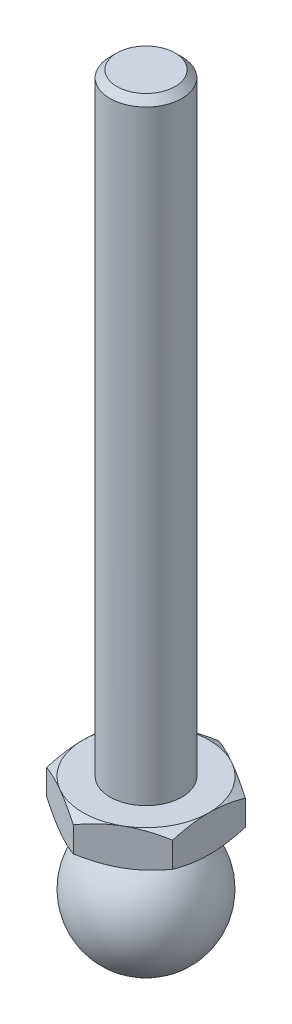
ISO-10303-21;
HEADER;
FILE_DESCRIPTION(('STEP AP214'),'2;1');
FILE_NAME('part.step','',(''),(''),'','','');
FILE_SCHEMA(('AUTOMOTIVE_DESIGN { 1 0 10303 214 1 1 1 1 }'));
ENDSEC;
DATA;
#1=APPLICATION_CONTEXT('core data for automotive mechanical design processes');
#2=APPLICATION_PROTOCOL_DEFINITION('international standard','automotive_design',2000,#1);
#3=PRODUCT_CONTEXT('',#1,'mechanical');
#4=PRODUCT('Part','Part','',(#3));
#5=PRODUCT_RELATED_PRODUCT_CATEGORY('part','',(#4));
#6=PRODUCT_DEFINITION_FORMATION('','',#4);
#7=PRODUCT_DEFINITION_CONTEXT('part definition',#1,'design');
#8=PRODUCT_DEFINITION('design','',#6,#7);
#9=PRODUCT_DEFINITION_SHAPE('','',#8);
#10=(LENGTH_UNIT() NAMED_UNIT(*) SI_UNIT(.MILLI.,.METRE.));
#11=(NAMED_UNIT(*) PLANE_ANGLE_UNIT() SI_UNIT($,.RADIAN.));
#12=(NAMED_UNIT(*) SI_UNIT($,.STERADIAN.) SOLID_ANGLE_UNIT());
#13=UNCERTAINTY_MEASURE_WITH_UNIT(LENGTH_MEASURE(1.E-05),#10,'distance_accuracy_value','');
#14=(GEOMETRIC_REPRESENTATION_CONTEXT(3) GLOBAL_UNCERTAINTY_ASSIGNED_CONTEXT((#13)) GLOBAL_UNIT_ASSIGNED_CONTEXT((#10,
#11,#12)) REPRESENTATION_CONTEXT('',''));
#15=CARTESIAN_POINT('',(0.,0.,0.));
#16=DIRECTION('',(0.,0.,1.));
#17=DIRECTION('',(1.,0.,0.));
#18=AXIS2_PLACEMENT_3D('',#15,#16,#17);
#19=CARTESIAN_POINT('',(0.,0.,0.));
#20=DIRECTION('',(0.,-1.,0.));
#21=DIRECTION('',(-1.,0.,0.));
#22=AXIS2_PLACEMENT_3D('',#19,#20,#21);
#23=SPHERICAL_SURFACE('',#22,7.);
#24=CARTESIAN_POINT('',(0.,5.74456264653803,0.));
#25=DIRECTION('',(0.,-1.,0.));
#26=DIRECTION('',(0.,0.,-1.));
#27=AXIS2_PLACEMENT_3D('',#24,#25,#26);
#28=CIRCLE('',#27,4.);
#29=CARTESIAN_POINT('',(0.,5.74456264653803,-4.));
#30=VERTEX_POINT('',#29);
#31=EDGE_CURVE('E348',#30,#30,#28,.F.);
#32=ORIENTED_EDGE('',*,*,#31,.F.);
#33=EDGE_LOOP('',(#32));
#34=FACE_BOUND('',#33,.T.);
#35=ADVANCED_FACE('F14',(#34),#23,.T.);
#36=CARTESIAN_POINT('',(0.,-7.,0.));
#37=DIRECTION('',(0.,-1.,0.));
#38=DIRECTION('',(0.,0.,-1.));
#39=AXIS2_PLACEMENT_3D('',#36,#37,#38);
#40=CYLINDRICAL_SURFACE('',#39,4.);
#41=ORIENTED_EDGE('',*,*,#31,.T.);
#42=EDGE_LOOP('',(#41));
#43=FACE_BOUND('',#42,.T.);
#44=CARTESIAN_POINT('',(0.,6.8,0.));
#45=DIRECTION('',(0.,-1.,0.));
#46=DIRECTION('',(0.,0.,-1.));
#47=AXIS2_PLACEMENT_3D('',#44,#45,#46);
#48=CIRCLE('',#47,4.);
#49=CARTESIAN_POINT('',(0.,6.8,-4.));
#50=VERTEX_POINT('',#49);
#51=EDGE_CURVE('E145',#50,#50,#48,.T.);
#52=ORIENTED_EDGE('',*,*,#51,.T.);
#53=EDGE_LOOP('',(#52));
#54=FACE_BOUND('',#53,.T.);
#55=ADVANCED_FACE('F340',(#43,#54),#40,.T.);
#56=CARTESIAN_POINT('',(7.,6.8,0.));
#57=DIRECTION('',(0.,1.,0.));
#58=DIRECTION('',(0.,0.,1.));
#59=AXIS2_PLACEMENT_3D('',#56,#57,#58);
#60=PLANE('',#59);
#61=ORIENTED_EDGE('',*,*,#51,.F.);
#62=EDGE_LOOP('',(#61));
#63=FACE_BOUND('',#62,.T.);
#64=CARTESIAN_POINT('',(0.,6.8,0.));
#65=DIRECTION('',(0.,-1.,0.));
#66=DIRECTION('',(0.,0.,-1.));
#67=AXIS2_PLACEMENT_3D('',#64,#65,#66);
#68=CIRCLE('',#67,7.);
#69=CARTESIAN_POINT('',(3.5,6.8,-6.06217782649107));
#70=VERTEX_POINT('',#69);
#71=CARTESIAN_POINT('',(7.,6.8,0.));
#72=VERTEX_POINT('',#71);
#73=EDGE_CURVE('E144',#70,#72,#68,.T.);
#74=ORIENTED_EDGE('',*,*,#73,.T.);
#75=CARTESIAN_POINT('',(3.5,6.8,6.06217782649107));
#76=VERTEX_POINT('',#75);
#77=EDGE_CURVE('E140',#72,#76,#68,.T.);
#78=ORIENTED_EDGE('',*,*,#77,.T.);
#79=CARTESIAN_POINT('',(-3.5,6.8,6.06217782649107));
#80=VERTEX_POINT('',#79);
#81=EDGE_CURVE('E143',#76,#80,#68,.T.);
#82=ORIENTED_EDGE('',*,*,#81,.T.);
#83=CARTESIAN_POINT('',(-7.,6.8,0.));
#84=VERTEX_POINT('',#83);
#85=EDGE_CURVE('E270',#80,#84,#68,.T.);
#86=ORIENTED_EDGE('',*,*,#85,.T.);
#87=CARTESIAN_POINT('',(-3.5,6.8,-6.06217782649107));
#88=VERTEX_POINT('',#87);
#89=EDGE_CURVE('E259',#84,#88,#68,.T.);
#90=ORIENTED_EDGE('',*,*,#89,.T.);
#91=EDGE_CURVE('E262',#88,#70,#68,.T.);
#92=ORIENTED_EDGE('',*,*,#91,.T.);
#93=EDGE_LOOP('',(#74,#78,#82,#86,#90,#92));
#94=FACE_BOUND('',#93,.T.);
#95=ADVANCED_FACE('F267',(#63,#94),#60,.F.);
#96=CARTESIAN_POINT('',(0.,7.60829037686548,0.));
#97=DIRECTION('',(0.,1.,0.));
#98=DIRECTION('',(0.,0.,1.));
#99=AXIS2_PLACEMENT_3D('',#96,#97,#98);
#100=CONICAL_SURFACE('',#99,8.4,1.0471975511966);
#101=CARTESIAN_POINT('',(-7.,10.8617173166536,-12.1648696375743));
#102=CARTESIAN_POINT('',(-7.,10.716084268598,-11.8738003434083));
#103=CARTESIAN_POINT('',(-7.,10.57145410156,-11.5822239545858));
#104=CARTESIAN_POINT('',(-7.,10.2846843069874,-10.997825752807));
#105=CARTESIAN_POINT('',(-7.,10.1425448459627,-10.7050038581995));
#106=CARTESIAN_POINT('',(-7.,9.86097785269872,-10.1173316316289));
#107=CARTESIAN_POINT('',(-7.,9.72155635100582,-9.82247840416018));
#108=CARTESIAN_POINT('',(-7.,9.44639395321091,-9.23106328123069));
#109=CARTESIAN_POINT('',(-7.,9.31065298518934,-8.93450141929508));
#110=CARTESIAN_POINT('',(-7.,9.03768895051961,-8.32593520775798));
#111=CARTESIAN_POINT('',(-7.,8.90067452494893,-8.01383696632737));
#112=CARTESIAN_POINT('',(-7.,8.63286162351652,-7.38695797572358));
#113=CARTESIAN_POINT('',(-7.,8.50206342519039,-7.07217710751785));
#114=CARTESIAN_POINT('',(-7.,8.24844698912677,-6.43962449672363));
#115=CARTESIAN_POINT('',(-7.,8.125623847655,-6.12185473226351));
#116=CARTESIAN_POINT('',(-7.,7.8900983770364,-5.48260317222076));
#117=CARTESIAN_POINT('',(-7.,7.77739494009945,-5.16112178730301));
#118=CARTESIAN_POINT('',(-7.,7.54009853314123,-4.4382173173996));
#119=CARTESIAN_POINT('',(-7.,7.41888185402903,-4.03566892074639));
#120=CARTESIAN_POINT('',(-7.,7.20302599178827,-3.22331060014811));
#121=CARTESIAN_POINT('',(-7.,7.10838447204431,-2.81350131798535));
#122=CARTESIAN_POINT('',(-7.,6.99300008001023,-2.19742561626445));
#123=CARTESIAN_POINT('',(-7.,6.95914818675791,-1.99359214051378));
#124=CARTESIAN_POINT('',(-7.,6.90068089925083,-1.58461613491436));
#125=CARTESIAN_POINT('',(-7.,6.8760641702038,-1.37947379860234));
#126=CARTESIAN_POINT('',(-7.,6.83680318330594,-0.968289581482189));
#127=CARTESIAN_POINT('',(-7.,6.82215603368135,-0.76224797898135));
#128=CARTESIAN_POINT('',(-7.,6.80329784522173,-0.349683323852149));
#129=CARTESIAN_POINT('',(-7.,6.79908676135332,-0.143160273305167));
#130=CARTESIAN_POINT('',(-7.,6.80125062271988,0.271082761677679));
#131=CARTESIAN_POINT('',(-7.,6.80768992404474,0.478802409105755));
#132=CARTESIAN_POINT('',(-7.,6.83105663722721,0.893645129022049));
#133=CARTESIAN_POINT('',(-7.,6.84798409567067,1.10076819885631));
#134=CARTESIAN_POINT('',(-7.,6.89178752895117,1.51403043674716));
#135=CARTESIAN_POINT('',(-7.,6.91866726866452,1.72016920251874));
#136=CARTESIAN_POINT('',(-7.,6.98158190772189,2.13103319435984));
#137=CARTESIAN_POINT('',(-7.,7.01761712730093,2.33575837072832));
#138=CARTESIAN_POINT('',(-7.,7.13943134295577,2.95437912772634));
#139=CARTESIAN_POINT('',(-7.,7.23812704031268,3.3657507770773));
#140=CARTESIAN_POINT('',(-7.,7.46154661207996,4.18138012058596));
#141=CARTESIAN_POINT('',(-7.,7.58628518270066,4.58563365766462));
#142=CARTESIAN_POINT('',(-7.,7.82667516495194,5.3032089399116));
#143=CARTESIAN_POINT('',(-7.,7.93871240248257,5.61775957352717));
#144=CARTESIAN_POINT('',(-7.,8.17214855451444,6.24325021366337));
#145=CARTESIAN_POINT('',(-7.,8.29354488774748,6.55419118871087));
#146=CARTESIAN_POINT('',(-7.,8.54379295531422,7.17328528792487));
#147=CARTESIAN_POINT('',(-7.,8.67264966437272,7.48143638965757));
#148=CARTESIAN_POINT('',(-7.,8.93621768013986,8.09523802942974));
#149=CARTESIAN_POINT('',(-7.,9.07092934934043,8.40088841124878));
#150=CARTESIAN_POINT('',(-7.,9.33921592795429,8.99716345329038));
#151=CARTESIAN_POINT('',(-7.,9.47259682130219,9.28787568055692));
#152=CARTESIAN_POINT('',(-7.,9.74285284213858,9.86766295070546));
#153=CARTESIAN_POINT('',(-7.,9.87972791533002,10.1567380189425));
#154=CARTESIAN_POINT('',(-7.,10.1561021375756,10.7329937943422));
#155=CARTESIAN_POINT('',(-7.,10.2955961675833,11.0201769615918));
#156=CARTESIAN_POINT('',(-7.,10.5769771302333,11.5933594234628));
#157=CARTESIAN_POINT('',(-7.,10.7188639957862,11.879358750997));
#158=CARTESIAN_POINT('',(-7.,10.8617173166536,12.1648696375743));
#159=B_SPLINE_CURVE_WITH_KNOTS('',3,(#101,#102,#103,#104,#105,#106,#107,#108,#109,#110,#111,
#112,#113,#114,#115,#116,#117,#118,#119,#120,#121,#122,#123,#124,#125,#126,#127,#128,#129,#130,
#131,#132,#133,#134,#135,#136,#137,#138,#139,#140,#141,#142,#143,#144,#145,#146,#147,#148,#149,
#150,#151,#152,#153,#154,#155,#156,#157,#158),.UNSPECIFIED.,.F.,.F.,(4,2,2,2,2,2,2,2,2,2,2,2,2,
2,2,2,2,2,2,2,2,2,2,2,2,2,2,2,4),(0.,0.976413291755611,1.95289161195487,2.93133423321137,
3.90975772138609,4.93225217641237,5.95479223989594,6.97669748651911,7.99849072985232,
9.25906449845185,10.5195273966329,11.1392271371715,11.7588372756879,12.3782676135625,
12.9976952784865,13.6208795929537,14.2440666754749,14.8674897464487,15.490934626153,
16.758797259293,18.0273773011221,19.0289263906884,20.0302002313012,21.0321496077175,
22.0341611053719,22.9936838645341,23.9531917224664,24.9109871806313,25.8687558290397),.UNSPECIFIED.);
#160=CARTESIAN_POINT('',(-7.,7.42521478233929,4.04145188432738));
#161=VERTEX_POINT('',#160);
#162=EDGE_CURVE('E156',#84,#161,#159,.T.);
#163=ORIENTED_EDGE('',*,*,#162,.F.);
#164=ORIENTED_EDGE('',*,*,#85,.F.);
#165=CARTESIAN_POINT('',(-7.0002,7.42528145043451,4.04133641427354));
#166=CARTESIAN_POINT('',(-6.84633209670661,7.37399984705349,4.13017208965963));
#167=CARTESIAN_POINT('',(-6.69189049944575,7.32504559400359,4.21933898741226));
#168=CARTESIAN_POINT('',(-6.38175307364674,7.23243278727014,4.39839691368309));
#169=CARTESIAN_POINT('',(-6.22605673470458,7.18877651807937,4.48828823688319));
#170=CARTESIAN_POINT('',(-5.75647483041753,7.0666115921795,4.75940147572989));
#171=CARTESIAN_POINT('',(-5.4407356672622,6.99712555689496,4.94169356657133));
#172=CARTESIAN_POINT('',(-4.96823775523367,6.9156449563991,5.21449036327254));
#173=CARTESIAN_POINT('',(-4.81289077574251,6.89243348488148,5.30417998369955));
#174=CARTESIAN_POINT('',(-4.50149488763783,6.85351121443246,5.48396448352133));
#175=CARTESIAN_POINT('',(-4.34544604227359,6.83779975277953,5.57405932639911));
#176=CARTESIAN_POINT('',(-4.03307732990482,6.81427791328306,5.75440548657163));
#177=CARTESIAN_POINT('',(-3.87675797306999,6.80645856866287,5.84465650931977));
#178=CARTESIAN_POINT('',(-3.56398349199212,6.79888024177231,6.02523694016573));
#179=CARTESIAN_POINT('',(-3.40752837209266,6.79912101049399,6.11556634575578));
#180=CARTESIAN_POINT('',(-2.97889312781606,6.8108597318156,6.36303901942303));
#181=CARTESIAN_POINT('',(-2.7068533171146,6.83056574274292,6.52010127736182));
#182=CARTESIAN_POINT('',(-2.1645805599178,6.89305346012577,6.83318259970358));
#183=CARTESIAN_POINT('',(-1.89434952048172,6.93585652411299,6.9892005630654));
#184=CARTESIAN_POINT('',(-1.35098545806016,7.04285167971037,7.30291195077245));
#185=CARTESIAN_POINT('',(-1.07792099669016,7.10749709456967,7.46056579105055));
#186=CARTESIAN_POINT('',(-0.535864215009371,7.25421607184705,7.77352241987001));
#187=CARTESIAN_POINT('',(-0.26686495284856,7.33625517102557,7.92882921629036));
#188=CARTESIAN_POINT('',(0.000200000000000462,7.42528145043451,8.08301923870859));
#189=B_SPLINE_CURVE_WITH_KNOTS('',3,(#165,#166,#167,#168,#169,#170,#171,#172,#173,#174,#175,
#176,#177,#178,#179,#180,#181,#182,#183,#184,#185,#186,#187,#188),.UNSPECIFIED.,.F.,.F.,(4,2,2,
2,2,2,2,2,2,2,2,4),(0.,0.554727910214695,1.10969417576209,2.2219327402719,2.76443041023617,
3.30688013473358,3.8487128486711,4.39052882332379,5.33376515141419,6.27787517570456,
7.2429241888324,8.20607866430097),.UNSPECIFIED.);
#190=EDGE_CURVE('E120',#161,#80,#189,.T.);
#191=ORIENTED_EDGE('',*,*,#190,.F.);
#192=EDGE_LOOP('',(#163,#164,#191));
#193=FACE_BOUND('',#192,.T.);
#194=ADVANCED_FACE('F280',(#193),#100,.T.);
#195=CARTESIAN_POINT('',(0.000200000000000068,7.42528145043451,-8.08301923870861));
#196=CARTESIAN_POINT('',(-0.153667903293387,7.37399984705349,-7.99418356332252));
#197=CARTESIAN_POINT('',(-0.308109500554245,7.32504559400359,-7.90501666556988));
#198=CARTESIAN_POINT('',(-0.618246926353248,7.23243278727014,-7.72595873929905));
#199=CARTESIAN_POINT('',(-0.77394326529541,7.18877651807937,-7.63606741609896));
#200=CARTESIAN_POINT('',(-1.24352516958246,7.0666115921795,-7.36495417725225));
#201=CARTESIAN_POINT('',(-1.5592643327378,6.99712555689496,-7.18266208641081));
#202=CARTESIAN_POINT('',(-2.03176224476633,6.9156449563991,-6.9098652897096));
#203=CARTESIAN_POINT('',(-2.18710922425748,6.89243348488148,-6.82017566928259));
#204=CARTESIAN_POINT('',(-2.49850511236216,6.85351121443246,-6.64039116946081));
#205=CARTESIAN_POINT('',(-2.65455395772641,6.83779975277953,-6.55029632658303));
#206=CARTESIAN_POINT('',(-2.96692267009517,6.81427791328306,-6.36995016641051));
#207=CARTESIAN_POINT('',(-3.12324202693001,6.80645856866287,-6.27969914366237));
#208=CARTESIAN_POINT('',(-3.43601650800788,6.79888024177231,-6.09911871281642));
#209=CARTESIAN_POINT('',(-3.59247162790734,6.79912101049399,-6.00878930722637));
#210=CARTESIAN_POINT('',(-4.02110687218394,6.8108597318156,-5.76131663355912));
#211=CARTESIAN_POINT('',(-4.2931466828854,6.83056574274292,-5.60425437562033));
#212=CARTESIAN_POINT('',(-4.83541944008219,6.89305346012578,-5.29117305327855));
#213=CARTESIAN_POINT('',(-5.10565047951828,6.93585652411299,-5.13515508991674));
#214=CARTESIAN_POINT('',(-5.64901454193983,7.04285167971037,-4.82144370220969));
#215=CARTESIAN_POINT('',(-5.92207900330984,7.10749709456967,-4.66378986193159));
#216=CARTESIAN_POINT('',(-6.46413578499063,7.25421607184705,-4.35083323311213));
#217=CARTESIAN_POINT('',(-6.73313504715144,7.33625517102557,-4.19552643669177));
#218=CARTESIAN_POINT('',(-7.0002,7.42528145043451,-4.04133641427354));
#219=B_SPLINE_CURVE_WITH_KNOTS('',3,(#195,#196,#197,#198,#199,#200,#201,#202,#203,#204,#205,
#206,#207,#208,#209,#210,#211,#212,#213,#214,#215,#216,#217,#218),.UNSPECIFIED.,.F.,.F.,(4,2,2,
2,2,2,2,2,2,2,2,4),(0.,0.554727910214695,1.10969417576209,2.2219327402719,2.76443041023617,
3.30688013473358,3.84871284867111,4.3905288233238,5.33376515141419,6.27787517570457,
7.24292418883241,8.20607866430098),.UNSPECIFIED.);
#220=CARTESIAN_POINT('',(-7.,7.42521478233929,-4.04145188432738));
#221=VERTEX_POINT('',#220);
#222=EDGE_CURVE('E213',#88,#221,#219,.T.);
#223=ORIENTED_EDGE('',*,*,#222,.F.);
#224=ORIENTED_EDGE('',*,*,#89,.F.);
#225=EDGE_CURVE('E155',#221,#84,#159,.T.);
#226=ORIENTED_EDGE('',*,*,#225,.F.);
#227=EDGE_LOOP('',(#223,#224,#226));
#228=FACE_BOUND('',#227,.T.);
#229=ADVANCED_FACE('F257',(#228),#100,.T.);
#230=CARTESIAN_POINT('',(7.0002,7.42528145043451,-4.04133641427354));
#231=CARTESIAN_POINT('',(6.84633209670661,7.37399984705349,-4.13017208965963));
#232=CARTESIAN_POINT('',(6.69189049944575,7.32504559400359,-4.21933898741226));
#233=CARTESIAN_POINT('',(6.38175307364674,7.23243278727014,-4.39839691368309));
#234=CARTESIAN_POINT('',(6.22605673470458,7.18877651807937,-4.48828823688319));
#235=CARTESIAN_POINT('',(5.75647483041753,7.0666115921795,-4.75940147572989));
#236=CARTESIAN_POINT('',(5.4407356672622,6.99712555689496,-4.94169356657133));
#237=CARTESIAN_POINT('',(4.96823775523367,6.9156449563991,-5.21449036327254));
#238=CARTESIAN_POINT('',(4.81289077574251,6.89243348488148,-5.30417998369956));
#239=CARTESIAN_POINT('',(4.50149488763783,6.85351121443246,-5.48396448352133));
#240=CARTESIAN_POINT('',(4.34544604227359,6.83779975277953,-5.57405932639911));
#241=CARTESIAN_POINT('',(4.03307732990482,6.81427791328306,-5.75440548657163));
#242=CARTESIAN_POINT('',(3.87675797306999,6.80645856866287,-5.84465650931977));
#243=CARTESIAN_POINT('',(3.56398349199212,6.79888024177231,-6.02523694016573));
#244=CARTESIAN_POINT('',(3.40752837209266,6.79912101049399,-6.11556634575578));
#245=CARTESIAN_POINT('',(2.97889312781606,6.8108597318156,-6.36303901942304));
#246=CARTESIAN_POINT('',(2.7068533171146,6.83056574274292,-6.52010127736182));
#247=CARTESIAN_POINT('',(2.1645805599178,6.89305346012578,-6.83318259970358));
#248=CARTESIAN_POINT('',(1.89434952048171,6.93585652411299,-6.9892005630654));
#249=CARTESIAN_POINT('',(1.35098545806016,7.04285167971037,-7.30291195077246));
#250=CARTESIAN_POINT('',(1.07792099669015,7.10749709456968,-7.46056579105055));
#251=CARTESIAN_POINT('',(0.535864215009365,7.25421607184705,-7.77352241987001));
#252=CARTESIAN_POINT('',(0.266864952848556,7.33625517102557,-7.92882921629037));
#253=CARTESIAN_POINT('',(-0.000200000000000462,7.42528145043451,-8.08301923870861));
#254=B_SPLINE_CURVE_WITH_KNOTS('',3,(#230,#231,#232,#233,#234,#235,#236,#237,#238,#239,#240,
#241,#242,#243,#244,#245,#246,#247,#248,#249,#250,#251,#252,#253),.UNSPECIFIED.,.F.,.F.,(4,2,2,
2,2,2,2,2,2,2,2,4),(0.,0.554727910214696,1.10969417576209,2.2219327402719,2.76443041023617,
3.30688013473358,3.8487128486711,4.39052882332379,5.33376515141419,6.27787517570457,
7.24292418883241,8.20607866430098),.UNSPECIFIED.);
#255=CARTESIAN_POINT('',(0.,7.42521478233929,-8.08290376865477));
#256=VERTEX_POINT('',#255);
#257=EDGE_CURVE('E231',#70,#256,#254,.T.);
#258=ORIENTED_EDGE('',*,*,#257,.F.);
#259=ORIENTED_EDGE('',*,*,#91,.F.);
#260=EDGE_CURVE('E211',#256,#88,#219,.T.);
#261=ORIENTED_EDGE('',*,*,#260,.F.);
#262=EDGE_LOOP('',(#258,#259,#261));
#263=FACE_BOUND('',#262,.T.);
#264=ADVANCED_FACE('F263',(#263),#100,.T.);
#265=CARTESIAN_POINT('',(-0.000200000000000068,7.42528145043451,8.08301923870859));
#266=CARTESIAN_POINT('',(0.153667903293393,7.37399984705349,7.99418356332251));
#267=CARTESIAN_POINT('',(0.308109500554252,7.32504559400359,7.90501666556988));
#268=CARTESIAN_POINT('',(0.618246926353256,7.23243278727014,7.72595873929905));
#269=CARTESIAN_POINT('',(0.773943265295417,7.18877651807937,7.63606741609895));
#270=CARTESIAN_POINT('',(1.24352516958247,7.0666115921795,7.36495417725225));
#271=CARTESIAN_POINT('',(1.5592643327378,6.99712555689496,7.18266208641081));
#272=CARTESIAN_POINT('',(2.03176224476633,6.9156449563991,6.9098652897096));
#273=CARTESIAN_POINT('',(2.18710922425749,6.89243348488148,6.82017566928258));
#274=CARTESIAN_POINT('',(2.49850511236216,6.85351121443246,6.64039116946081));
#275=CARTESIAN_POINT('',(2.65455395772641,6.83779975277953,6.55029632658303));
#276=CARTESIAN_POINT('',(2.96692267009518,6.81427791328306,6.36995016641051));
#277=CARTESIAN_POINT('',(3.12324202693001,6.80645856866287,6.27969914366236));
#278=CARTESIAN_POINT('',(3.43601650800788,6.79888024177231,6.09911871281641));
#279=CARTESIAN_POINT('',(3.59247162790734,6.79912101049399,6.00878930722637));
#280=CARTESIAN_POINT('',(4.02110687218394,6.8108597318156,5.76131663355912));
#281=CARTESIAN_POINT('',(4.2931466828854,6.83056574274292,5.60425437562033));
#282=CARTESIAN_POINT('',(4.83541944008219,6.89305346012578,5.29117305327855));
#283=CARTESIAN_POINT('',(5.10565047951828,6.93585652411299,5.13515508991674));
#284=CARTESIAN_POINT('',(5.64901454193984,7.04285167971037,4.82144370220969));
#285=CARTESIAN_POINT('',(5.92207900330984,7.10749709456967,4.66378986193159));
#286=CARTESIAN_POINT('',(6.46413578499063,7.25421607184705,4.35083323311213));
#287=CARTESIAN_POINT('',(6.73313504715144,7.33625517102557,4.19552643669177));
#288=CARTESIAN_POINT('',(7.0002,7.42528145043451,4.04133641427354));
#289=B_SPLINE_CURVE_WITH_KNOTS('',3,(#265,#266,#267,#268,#269,#270,#271,#272,#273,#274,#275,
#276,#277,#278,#279,#280,#281,#282,#283,#284,#285,#286,#287,#288),.UNSPECIFIED.,.F.,.F.,(4,2,2,
2,2,2,2,2,2,2,2,4),(0.,0.554727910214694,1.10969417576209,2.2219327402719,2.76443041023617,
3.30688013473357,3.8487128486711,4.39052882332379,5.33376515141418,6.27787517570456,
7.2429241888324,8.20607866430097),.UNSPECIFIED.);
#290=CARTESIAN_POINT('',(0.,7.42521478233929,8.08290376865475));
#291=VERTEX_POINT('',#290);
#292=EDGE_CURVE('E276',#291,#76,#289,.T.);
#293=ORIENTED_EDGE('',*,*,#292,.F.);
#294=EDGE_CURVE('E32',#80,#291,#189,.T.);
#295=ORIENTED_EDGE('',*,*,#294,.F.);
#296=ORIENTED_EDGE('',*,*,#81,.F.);
#297=EDGE_LOOP('',(#293,#295,#296));
#298=FACE_BOUND('',#297,.T.);
#299=ADVANCED_FACE('F275',(#298),#100,.T.);
#300=CARTESIAN_POINT('',(7.,7.42521478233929,-4.04145188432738));
#301=VERTEX_POINT('',#300);
#302=EDGE_CURVE('E237',#301,#70,#254,.T.);
#303=ORIENTED_EDGE('',*,*,#302,.F.);
#304=CARTESIAN_POINT('',(7.,10.8617173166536,12.1648696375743));
#305=CARTESIAN_POINT('',(7.,10.716084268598,11.8738003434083));
#306=CARTESIAN_POINT('',(7.,10.57145410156,11.5822239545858));
#307=CARTESIAN_POINT('',(7.,10.2846843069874,10.997825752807));
#308=CARTESIAN_POINT('',(7.,10.1425448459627,10.7050038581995));
#309=CARTESIAN_POINT('',(7.,9.86097785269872,10.1173316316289));
#310=CARTESIAN_POINT('',(7.,9.72155635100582,9.82247840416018));
#311=CARTESIAN_POINT('',(7.,9.44639395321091,9.23106328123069));
#312=CARTESIAN_POINT('',(7.,9.31065298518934,8.93450141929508));
#313=CARTESIAN_POINT('',(7.,9.03768895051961,8.32593520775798));
#314=CARTESIAN_POINT('',(7.,8.90067452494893,8.01383696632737));
#315=CARTESIAN_POINT('',(7.,8.63286162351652,7.38695797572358));
#316=CARTESIAN_POINT('',(7.,8.50206342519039,7.07217710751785));
#317=CARTESIAN_POINT('',(7.,8.24844698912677,6.43962449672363));
#318=CARTESIAN_POINT('',(7.,8.125623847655,6.12185473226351));
#319=CARTESIAN_POINT('',(7.,7.8900983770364,5.48260317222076));
#320=CARTESIAN_POINT('',(7.,7.77739494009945,5.16112178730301));
#321=CARTESIAN_POINT('',(7.,7.54009853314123,4.4382173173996));
#322=CARTESIAN_POINT('',(7.,7.41888185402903,4.03566892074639));
#323=CARTESIAN_POINT('',(7.,7.20302599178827,3.22331060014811));
#324=CARTESIAN_POINT('',(7.,7.10838447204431,2.81350131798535));
#325=CARTESIAN_POINT('',(7.,6.99300008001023,2.19742561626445));
#326=CARTESIAN_POINT('',(7.,6.95914818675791,1.99359214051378));
#327=CARTESIAN_POINT('',(7.,6.90068089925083,1.58461613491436));
#328=CARTESIAN_POINT('',(7.,6.8760641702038,1.37947379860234));
#329=CARTESIAN_POINT('',(7.,6.83680318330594,0.968289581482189));
#330=CARTESIAN_POINT('',(7.,6.82215603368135,0.76224797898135));
#331=CARTESIAN_POINT('',(7.,6.80329784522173,0.349683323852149));
#332=CARTESIAN_POINT('',(7.,6.79908676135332,0.143160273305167));
#333=CARTESIAN_POINT('',(7.,6.80125062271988,-0.271082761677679));
#334=CARTESIAN_POINT('',(7.,6.80768992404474,-0.478802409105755));
#335=CARTESIAN_POINT('',(7.,6.83105663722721,-0.893645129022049));
#336=CARTESIAN_POINT('',(7.,6.84798409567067,-1.10076819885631));
#337=CARTESIAN_POINT('',(7.,6.89178752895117,-1.51403043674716));
#338=CARTESIAN_POINT('',(7.,6.91866726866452,-1.72016920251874));
#339=CARTESIAN_POINT('',(7.,6.98158190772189,-2.13103319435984));
#340=CARTESIAN_POINT('',(7.,7.01761712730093,-2.33575837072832));
#341=CARTESIAN_POINT('',(7.,7.13943134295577,-2.95437912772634));
#342=CARTESIAN_POINT('',(7.,7.23812704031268,-3.3657507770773));
#343=CARTESIAN_POINT('',(7.,7.46154661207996,-4.18138012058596));
#344=CARTESIAN_POINT('',(7.,7.58628518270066,-4.58563365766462));
#345=CARTESIAN_POINT('',(7.,7.82667516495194,-5.3032089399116));
#346=CARTESIAN_POINT('',(7.,7.93871240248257,-5.61775957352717));
#347=CARTESIAN_POINT('',(7.,8.17214855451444,-6.24325021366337));
#348=CARTESIAN_POINT('',(7.,8.29354488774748,-6.55419118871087));
#349=CARTESIAN_POINT('',(7.,8.54379295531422,-7.17328528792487));
#350=CARTESIAN_POINT('',(7.,8.67264966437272,-7.48143638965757));
#351=CARTESIAN_POINT('',(7.,8.93621768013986,-8.09523802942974));
#352=CARTESIAN_POINT('',(7.,9.07092934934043,-8.40088841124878));
#353=CARTESIAN_POINT('',(7.,9.33921592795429,-8.99716345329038));
#354=CARTESIAN_POINT('',(7.,9.47259682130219,-9.28787568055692));
#355=CARTESIAN_POINT('',(7.,9.74285284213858,-9.86766295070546));
#356=CARTESIAN_POINT('',(7.,9.87972791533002,-10.1567380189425));
#357=CARTESIAN_POINT('',(7.,10.1561021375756,-10.7329937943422));
#358=CARTESIAN_POINT('',(7.,10.2955961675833,-11.0201769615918));
#359=CARTESIAN_POINT('',(7.,10.5769771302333,-11.5933594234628));
#360=CARTESIAN_POINT('',(7.,10.7188639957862,-11.879358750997));
#361=CARTESIAN_POINT('',(7.,10.8617173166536,-12.1648696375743));
#362=B_SPLINE_CURVE_WITH_KNOTS('',3,(#304,#305,#306,#307,#308,#309,#310,#311,#312,#313,#314,
#315,#316,#317,#318,#319,#320,#321,#322,#323,#324,#325,#326,#327,#328,#329,#330,#331,#332,#333,
#334,#335,#336,#337,#338,#339,#340,#341,#342,#343,#344,#345,#346,#347,#348,#349,#350,#351,#352,
#353,#354,#355,#356,#357,#358,#359,#360,#361),.UNSPECIFIED.,.F.,.F.,(4,2,2,2,2,2,2,2,2,2,2,2,2,
2,2,2,2,2,2,2,2,2,2,2,2,2,2,2,4),(0.,0.976413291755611,1.95289161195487,2.93133423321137,
3.90975772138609,4.93225217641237,5.95479223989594,6.97669748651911,7.99849072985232,
9.25906449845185,10.5195273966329,11.1392271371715,11.7588372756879,12.3782676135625,
12.9976952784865,13.6208795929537,14.2440666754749,14.8674897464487,15.490934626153,
16.758797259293,18.0273773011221,19.0289263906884,20.0302002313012,21.0321496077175,
22.0341611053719,22.9936838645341,23.9531917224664,24.9109871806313,25.8687558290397),.UNSPECIFIED.);
#363=EDGE_CURVE('E310',#72,#301,#362,.T.);
#364=ORIENTED_EDGE('',*,*,#363,.F.);
#365=ORIENTED_EDGE('',*,*,#73,.F.);
#366=EDGE_LOOP('',(#303,#364,#365));
#367=FACE_BOUND('',#366,.T.);
#368=ADVANCED_FACE('F168',(#367),#100,.T.);
#369=CARTESIAN_POINT('',(7.,7.42521478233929,4.04145188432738));
#370=VERTEX_POINT('',#369);
#371=EDGE_CURVE('E312',#370,#72,#362,.T.);
#372=ORIENTED_EDGE('',*,*,#371,.F.);
#373=EDGE_CURVE('E111',#76,#370,#289,.T.);
#374=ORIENTED_EDGE('',*,*,#373,.F.);
#375=ORIENTED_EDGE('',*,*,#77,.F.);
#376=EDGE_LOOP('',(#372,#374,#375));
#377=FACE_BOUND('',#376,.T.);
#378=ADVANCED_FACE('F297',(#377),#100,.T.);
#379=CARTESIAN_POINT('',(-7.,6.8,4.04145188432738));
#380=DIRECTION('',(-0.5,0.,0.866025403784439));
#381=DIRECTION('',(0.866025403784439,0.,0.5));
#382=AXIS2_PLACEMENT_3D('',#379,#380,#381);
#383=PLANE('',#382);
#384=CARTESIAN_POINT('',(0.00020000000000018,10.2247185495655,8.0830192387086));
#385=CARTESIAN_POINT('',(-0.153667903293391,10.2760001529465,7.99418356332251));
#386=CARTESIAN_POINT('',(-0.30810950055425,10.3249544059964,7.90501666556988));
#387=CARTESIAN_POINT('',(-0.618246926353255,10.4175672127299,7.72595873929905));
#388=CARTESIAN_POINT('',(-0.773943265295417,10.4612234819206,7.63606741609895));
#389=CARTESIAN_POINT('',(-1.24352516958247,10.5833884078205,7.36495417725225));
#390=CARTESIAN_POINT('',(-1.5592643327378,10.652874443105,7.18266208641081));
#391=CARTESIAN_POINT('',(-2.03176224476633,10.7343550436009,6.9098652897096));
#392=CARTESIAN_POINT('',(-2.18710922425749,10.7575665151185,6.82017566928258));
#393=CARTESIAN_POINT('',(-2.49850511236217,10.7964887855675,6.64039116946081));
#394=CARTESIAN_POINT('',(-2.65455395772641,10.8122002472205,6.55029632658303));
#395=CARTESIAN_POINT('',(-2.96692267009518,10.8357220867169,6.3699501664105));
#396=CARTESIAN_POINT('',(-3.12324202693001,10.8435414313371,6.27969914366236));
#397=CARTESIAN_POINT('',(-3.43601650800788,10.8511197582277,6.09911871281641));
#398=CARTESIAN_POINT('',(-3.59247162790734,10.850878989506,6.00878930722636));
#399=CARTESIAN_POINT('',(-4.02110687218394,10.8391402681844,5.76131663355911));
#400=CARTESIAN_POINT('',(-4.2931466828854,10.8194342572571,5.60425437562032));
#401=CARTESIAN_POINT('',(-4.8354194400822,10.7569465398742,5.29117305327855));
#402=CARTESIAN_POINT('',(-5.10565047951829,10.714143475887,5.13515508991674));
#403=CARTESIAN_POINT('',(-5.64901454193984,10.6071483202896,4.82144370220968));
#404=CARTESIAN_POINT('',(-5.92207900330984,10.5425029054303,4.66378986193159));
#405=CARTESIAN_POINT('',(-6.46413578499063,10.395783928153,4.35083323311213));
#406=CARTESIAN_POINT('',(-6.73313504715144,10.3137448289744,4.19552643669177));
#407=CARTESIAN_POINT('',(-7.0002,10.2247185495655,4.04133641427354));
#408=B_SPLINE_CURVE_WITH_KNOTS('',3,(#384,#385,#386,#387,#388,#389,#390,#391,#392,#393,#394,
#395,#396,#397,#398,#399,#400,#401,#402,#403,#404,#405,#406,#407),.UNSPECIFIED.,.F.,.F.,(4,2,2,
2,2,2,2,2,2,2,2,4),(0.,0.554727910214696,1.10969417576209,2.2219327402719,2.76443041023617,
3.30688013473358,3.84871284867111,4.3905288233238,5.33376515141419,6.27787517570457,
7.2429241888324,8.20607866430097),.UNSPECIFIED.);
#409=CARTESIAN_POINT('',(0.,10.2247852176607,8.08290376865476));
#410=VERTEX_POINT('',#409);
#411=CARTESIAN_POINT('',(-3.5,10.85,6.06217782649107));
#412=VERTEX_POINT('',#411);
#413=EDGE_CURVE('E104',#410,#412,#408,.T.);
#414=ORIENTED_EDGE('',*,*,#413,.T.);
#415=CARTESIAN_POINT('',(-7.,10.2247852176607,4.04145188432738));
#416=VERTEX_POINT('',#415);
#417=EDGE_CURVE('E108',#412,#416,#408,.T.);
#418=ORIENTED_EDGE('',*,*,#417,.T.);
#419=DIRECTION('',(0.,1.,0.));
#420=VECTOR('',#419,1.);
#421=CARTESIAN_POINT('',(-7.,6.8,4.04145188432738));
#422=LINE('',#421,#420);
#423=EDGE_CURVE('E9',#161,#416,#422,.T.);
#424=ORIENTED_EDGE('',*,*,#423,.F.);
#425=ORIENTED_EDGE('',*,*,#190,.T.);
#426=ORIENTED_EDGE('',*,*,#294,.T.);
#427=DIRECTION('',(0.,1.,0.));
#428=VECTOR('',#427,1.);
#429=CARTESIAN_POINT('',(0.,6.8,8.08290376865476));
#430=LINE('',#429,#428);
#431=EDGE_CURVE('E24',#291,#410,#430,.T.);
#432=ORIENTED_EDGE('',*,*,#431,.T.);
#433=EDGE_LOOP('',(#414,#418,#424,#425,#426,#432));
#434=FACE_BOUND('',#433,.T.);
#435=ADVANCED_FACE('F106',(#434),#383,.T.);
#436=CARTESIAN_POINT('',(-7.,6.8,-4.04145188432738));
#437=DIRECTION('',(-1.,0.,0.));
#438=DIRECTION('',(0.,0.,1.));
#439=AXIS2_PLACEMENT_3D('',#436,#437,#438);
#440=PLANE('',#439);
#441=CARTESIAN_POINT('',(-7.,6.7882826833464,12.1648696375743));
#442=CARTESIAN_POINT('',(-7.,6.93391573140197,11.8738003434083));
#443=CARTESIAN_POINT('',(-7.,7.07854589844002,11.5822239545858));
#444=CARTESIAN_POINT('',(-7.,7.36531569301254,10.997825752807));
#445=CARTESIAN_POINT('',(-7.,7.50745515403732,10.7050038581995));
#446=CARTESIAN_POINT('',(-7.,7.78902214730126,10.117331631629));
#447=CARTESIAN_POINT('',(-7.,7.92844364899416,9.82247840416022));
#448=CARTESIAN_POINT('',(-7.,8.20360604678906,9.23106328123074));
#449=CARTESIAN_POINT('',(-7.,8.33934701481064,8.93450141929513));
#450=CARTESIAN_POINT('',(-7.,8.61231104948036,8.32593520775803));
#451=CARTESIAN_POINT('',(-7.,8.74932547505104,8.01383696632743));
#452=CARTESIAN_POINT('',(-7.,9.01713837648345,7.38695797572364));
#453=CARTESIAN_POINT('',(-7.,9.14793657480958,7.07217710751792));
#454=CARTESIAN_POINT('',(-7.,9.4015530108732,6.4396244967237));
#455=CARTESIAN_POINT('',(-7.,9.52437615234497,6.12185473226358));
#456=CARTESIAN_POINT('',(-7.,9.75990162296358,5.48260317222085));
#457=CARTESIAN_POINT('',(-7.,9.87260505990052,5.16112178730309));
#458=CARTESIAN_POINT('',(-7.,10.1099014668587,4.43821731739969));
#459=CARTESIAN_POINT('',(-7.,10.2311181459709,4.03566892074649));
#460=CARTESIAN_POINT('',(-7.,10.4469740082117,3.22331060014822));
#461=CARTESIAN_POINT('',(-7.,10.5416155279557,2.81350131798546));
#462=CARTESIAN_POINT('',(-7.,10.6569999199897,2.19742561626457));
#463=CARTESIAN_POINT('',(-7.,10.6908518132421,1.99359214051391));
#464=CARTESIAN_POINT('',(-7.,10.7493191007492,1.58461613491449));
#465=CARTESIAN_POINT('',(-7.,10.7739358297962,1.37947379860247));
#466=CARTESIAN_POINT('',(-7.,10.8131968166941,0.96828958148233));
#467=CARTESIAN_POINT('',(-7.,10.8278439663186,0.762247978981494));
#468=CARTESIAN_POINT('',(-7.,10.8467021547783,0.349683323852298));
#469=CARTESIAN_POINT('',(-7.,10.8509132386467,0.143160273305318));
#470=CARTESIAN_POINT('',(-7.,10.8487493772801,-0.271082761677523));
#471=CARTESIAN_POINT('',(-7.,10.8423100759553,-0.478802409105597));
#472=CARTESIAN_POINT('',(-7.,10.8189433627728,-0.893645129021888));
#473=CARTESIAN_POINT('',(-7.,10.8020159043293,-1.10076819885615));
#474=CARTESIAN_POINT('',(-7.,10.7582124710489,-1.514030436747));
#475=CARTESIAN_POINT('',(-7.,10.7313327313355,-1.72016920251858));
#476=CARTESIAN_POINT('',(-7.,10.6684180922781,-2.13103319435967));
#477=CARTESIAN_POINT('',(-7.,10.6323828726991,-2.33575837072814));
#478=CARTESIAN_POINT('',(-7.,10.5105686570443,-2.95437912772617));
#479=CARTESIAN_POINT('',(-7.,10.4118729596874,-3.36575077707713));
#480=CARTESIAN_POINT('',(-7.,10.1884533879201,-4.18138012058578));
#481=CARTESIAN_POINT('',(-7.,10.0637148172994,-4.58563365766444));
#482=CARTESIAN_POINT('',(-7.,9.82332483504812,-5.30320893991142));
#483=CARTESIAN_POINT('',(-7.,9.71128759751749,-5.617759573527));
#484=CARTESIAN_POINT('',(-7.,9.47785144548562,-6.24325021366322));
#485=CARTESIAN_POINT('',(-7.,9.35645511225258,-6.55419118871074));
#486=CARTESIAN_POINT('',(-7.,9.10620704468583,-7.17328528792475));
#487=CARTESIAN_POINT('',(-7.,8.97735033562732,-7.48143638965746));
#488=CARTESIAN_POINT('',(-7.,8.71378231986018,-8.09523802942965));
#489=CARTESIAN_POINT('',(-7.,8.57907065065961,-8.40088841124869));
#490=CARTESIAN_POINT('',(-7.,8.31078407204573,-8.99716345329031));
#491=CARTESIAN_POINT('',(-7.,8.17740317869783,-9.28787568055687));
#492=CARTESIAN_POINT('',(-7.,7.90714715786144,-9.86766295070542));
#493=CARTESIAN_POINT('',(-7.,7.77027208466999,-10.1567380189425));
#494=CARTESIAN_POINT('',(-7.,7.49389786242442,-10.7329937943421));
#495=CARTESIAN_POINT('',(-7.,7.35440383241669,-11.0201769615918));
#496=CARTESIAN_POINT('',(-7.,7.07302286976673,-11.5933594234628));
#497=CARTESIAN_POINT('',(-7.,6.93113600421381,-11.879358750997));
#498=CARTESIAN_POINT('',(-7.,6.7882826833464,-12.1648696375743));
#499=B_SPLINE_CURVE_WITH_KNOTS('',3,(#441,#442,#443,#444,#445,#446,#447,#448,#449,#450,#451,
#452,#453,#454,#455,#456,#457,#458,#459,#460,#461,#462,#463,#464,#465,#466,#467,#468,#469,#470,
#471,#472,#473,#474,#475,#476,#477,#478,#479,#480,#481,#482,#483,#484,#485,#486,#487,#488,#489,
#490,#491,#492,#493,#494,#495,#496,#497,#498),.UNSPECIFIED.,.F.,.F.,(4,2,2,2,2,2,2,2,2,2,2,2,2,
2,2,2,2,2,2,2,2,2,2,2,2,2,2,2,4),(0.,0.976413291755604,1.95289161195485,2.93133423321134,
3.90975772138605,4.93225217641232,5.95479223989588,6.97669748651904,7.99849072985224,
9.25906449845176,10.5195273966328,11.1392271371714,11.7588372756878,12.3782676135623,
12.9976952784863,13.6208795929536,14.2440666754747,14.8674897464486,15.4909346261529,
16.7587972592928,18.0273773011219,19.0289263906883,20.0302002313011,21.0321496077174,
22.0341611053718,22.9936838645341,23.9531917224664,24.9109871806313,25.8687558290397),.UNSPECIFIED.);
#500=CARTESIAN_POINT('',(-7.,10.85,0.));
#501=VERTEX_POINT('',#500);
#502=EDGE_CURVE('E119',#416,#501,#499,.T.);
#503=ORIENTED_EDGE('',*,*,#502,.T.);
#504=CARTESIAN_POINT('',(-7.,10.2247852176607,-4.04145188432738));
#505=VERTEX_POINT('',#504);
#506=EDGE_CURVE('E148',#501,#505,#499,.T.);
#507=ORIENTED_EDGE('',*,*,#506,.T.);
#508=DIRECTION('',(0.,1.,0.));
#509=VECTOR('',#508,1.);
#510=CARTESIAN_POINT('',(-7.,6.8,-4.04145188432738));
#511=LINE('',#510,#509);
#512=EDGE_CURVE('E19',#221,#505,#511,.T.);
#513=ORIENTED_EDGE('',*,*,#512,.F.);
#514=ORIENTED_EDGE('',*,*,#225,.T.);
#515=ORIENTED_EDGE('',*,*,#162,.T.);
#516=ORIENTED_EDGE('',*,*,#423,.T.);
#517=EDGE_LOOP('',(#503,#507,#513,#514,#515,#516));
#518=FACE_BOUND('',#517,.T.);
#519=ADVANCED_FACE('F16',(#518),#440,.T.);
#520=CARTESIAN_POINT('',(0.,6.8,-8.08290376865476));
#521=DIRECTION('',(-0.5,0.,-0.866025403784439));
#522=DIRECTION('',(-0.866025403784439,0.,0.5));
#523=AXIS2_PLACEMENT_3D('',#520,#521,#522);
#524=PLANE('',#523);
#525=CARTESIAN_POINT('',(-7.0002,10.2247185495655,-4.04133641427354));
#526=CARTESIAN_POINT('',(-6.84633209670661,10.2760001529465,-4.13017208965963));
#527=CARTESIAN_POINT('',(-6.69189049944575,10.3249544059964,-4.21933898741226));
#528=CARTESIAN_POINT('',(-6.38175307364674,10.4175672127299,-4.39839691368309));
#529=CARTESIAN_POINT('',(-6.22605673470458,10.4612234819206,-4.48828823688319));
#530=CARTESIAN_POINT('',(-5.75647483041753,10.5833884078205,-4.75940147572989));
#531=CARTESIAN_POINT('',(-5.44073566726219,10.652874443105,-4.94169356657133));
#532=CARTESIAN_POINT('',(-4.96823775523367,10.7343550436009,-5.21449036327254));
#533=CARTESIAN_POINT('',(-4.81289077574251,10.7575665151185,-5.30417998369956));
#534=CARTESIAN_POINT('',(-4.50149488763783,10.7964887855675,-5.48396448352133));
#535=CARTESIAN_POINT('',(-4.34544604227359,10.8122002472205,-5.57405932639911));
#536=CARTESIAN_POINT('',(-4.03307732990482,10.8357220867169,-5.75440548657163));
#537=CARTESIAN_POINT('',(-3.87675797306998,10.8435414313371,-5.84465650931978));
#538=CARTESIAN_POINT('',(-3.56398349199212,10.8511197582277,-6.02523694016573));
#539=CARTESIAN_POINT('',(-3.40752837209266,10.850878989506,-6.11556634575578));
#540=CARTESIAN_POINT('',(-2.97889312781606,10.8391402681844,-6.36303901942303));
#541=CARTESIAN_POINT('',(-2.70685331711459,10.8194342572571,-6.52010127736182));
#542=CARTESIAN_POINT('',(-2.1645805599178,10.7569465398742,-6.83318259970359));
#543=CARTESIAN_POINT('',(-1.89434952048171,10.714143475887,-6.9892005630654));
#544=CARTESIAN_POINT('',(-1.35098545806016,10.6071483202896,-7.30291195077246));
#545=CARTESIAN_POINT('',(-1.07792099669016,10.5425029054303,-7.46056579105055));
#546=CARTESIAN_POINT('',(-0.535864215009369,10.395783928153,-7.77352241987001));
#547=CARTESIAN_POINT('',(-0.266864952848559,10.3137448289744,-7.92882921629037));
#548=CARTESIAN_POINT('',(0.000200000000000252,10.2247185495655,-8.0830192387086));
#549=B_SPLINE_CURVE_WITH_KNOTS('',3,(#525,#526,#527,#528,#529,#530,#531,#532,#533,#534,#535,
#536,#537,#538,#539,#540,#541,#542,#543,#544,#545,#546,#547,#548),.UNSPECIFIED.,.F.,.F.,(4,2,2,
2,2,2,2,2,2,2,2,4),(0.,0.554727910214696,1.10969417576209,2.2219327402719,2.76443041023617,
3.30688013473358,3.8487128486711,4.3905288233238,5.33376515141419,6.27787517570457,
7.2429241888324,8.20607866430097),.UNSPECIFIED.);
#550=CARTESIAN_POINT('',(-3.5,10.85,-6.06217782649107));
#551=VERTEX_POINT('',#550);
#552=EDGE_CURVE('E212',#505,#551,#549,.T.);
#553=ORIENTED_EDGE('',*,*,#552,.T.);
#554=CARTESIAN_POINT('',(0.,10.2247852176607,-8.08290376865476));
#555=VERTEX_POINT('',#554);
#556=EDGE_CURVE('E206',#551,#555,#549,.T.);
#557=ORIENTED_EDGE('',*,*,#556,.T.);
#558=DIRECTION('',(0.,1.,0.));
#559=VECTOR('',#558,1.);
#560=CARTESIAN_POINT('',(0.,6.8,-8.08290376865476));
#561=LINE('',#560,#559);
#562=EDGE_CURVE('E251',#256,#555,#561,.T.);
#563=ORIENTED_EDGE('',*,*,#562,.F.);
#564=ORIENTED_EDGE('',*,*,#260,.T.);
#565=ORIENTED_EDGE('',*,*,#222,.T.);
#566=ORIENTED_EDGE('',*,*,#512,.T.);
#567=EDGE_LOOP('',(#553,#557,#563,#564,#565,#566));
#568=FACE_BOUND('',#567,.T.);
#569=ADVANCED_FACE('F218',(#568),#524,.T.);
#570=CARTESIAN_POINT('',(7.,6.8,-4.04145188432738));
#571=DIRECTION('',(0.5,0.,-0.866025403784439));
#572=DIRECTION('',(-0.866025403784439,0.,-0.5));
#573=AXIS2_PLACEMENT_3D('',#570,#571,#572);
#574=PLANE('',#573);
#575=CARTESIAN_POINT('',(-0.00020000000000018,10.2247185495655,-8.0830192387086));
#576=CARTESIAN_POINT('',(0.153667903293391,10.2760001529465,-7.99418356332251));
#577=CARTESIAN_POINT('',(0.30810950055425,10.3249544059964,-7.90501666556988));
#578=CARTESIAN_POINT('',(0.618246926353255,10.4175672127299,-7.72595873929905));
#579=CARTESIAN_POINT('',(0.773943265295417,10.4612234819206,-7.63606741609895));
#580=CARTESIAN_POINT('',(1.24352516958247,10.5833884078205,-7.36495417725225));
#581=CARTESIAN_POINT('',(1.5592643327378,10.652874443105,-7.18266208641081));
#582=CARTESIAN_POINT('',(2.03176224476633,10.7343550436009,-6.9098652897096));
#583=CARTESIAN_POINT('',(2.18710922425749,10.7575665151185,-6.82017566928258));
#584=CARTESIAN_POINT('',(2.49850511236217,10.7964887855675,-6.64039116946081));
#585=CARTESIAN_POINT('',(2.65455395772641,10.8122002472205,-6.55029632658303));
#586=CARTESIAN_POINT('',(2.96692267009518,10.8357220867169,-6.3699501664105));
#587=CARTESIAN_POINT('',(3.12324202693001,10.8435414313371,-6.27969914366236));
#588=CARTESIAN_POINT('',(3.43601650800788,10.8511197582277,-6.09911871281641));
#589=CARTESIAN_POINT('',(3.59247162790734,10.850878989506,-6.00878930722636));
#590=CARTESIAN_POINT('',(4.02110687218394,10.8391402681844,-5.76131663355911));
#591=CARTESIAN_POINT('',(4.2931466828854,10.8194342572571,-5.60425437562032));
#592=CARTESIAN_POINT('',(4.8354194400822,10.7569465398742,-5.29117305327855));
#593=CARTESIAN_POINT('',(5.10565047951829,10.714143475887,-5.13515508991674));
#594=CARTESIAN_POINT('',(5.64901454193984,10.6071483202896,-4.82144370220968));
#595=CARTESIAN_POINT('',(5.92207900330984,10.5425029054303,-4.66378986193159));
#596=CARTESIAN_POINT('',(6.46413578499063,10.395783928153,-4.35083323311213));
#597=CARTESIAN_POINT('',(6.73313504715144,10.3137448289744,-4.19552643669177));
#598=CARTESIAN_POINT('',(7.0002,10.2247185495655,-4.04133641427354));
#599=B_SPLINE_CURVE_WITH_KNOTS('',3,(#575,#576,#577,#578,#579,#580,#581,#582,#583,#584,#585,
#586,#587,#588,#589,#590,#591,#592,#593,#594,#595,#596,#597,#598),.UNSPECIFIED.,.F.,.F.,(4,2,2,
2,2,2,2,2,2,2,2,4),(0.,0.554727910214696,1.10969417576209,2.2219327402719,2.76443041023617,
3.30688013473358,3.84871284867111,4.3905288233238,5.33376515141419,6.27787517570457,
7.2429241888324,8.20607866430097),.UNSPECIFIED.);
#600=CARTESIAN_POINT('',(3.5,10.85,-6.06217782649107));
#601=VERTEX_POINT('',#600);
#602=EDGE_CURVE('E243',#555,#601,#599,.T.);
#603=ORIENTED_EDGE('',*,*,#602,.T.);
#604=CARTESIAN_POINT('',(7.,10.2247852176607,-4.04145188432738));
#605=VERTEX_POINT('',#604);
#606=EDGE_CURVE('E199',#601,#605,#599,.T.);
#607=ORIENTED_EDGE('',*,*,#606,.T.);
#608=DIRECTION('',(0.,1.,0.));
#609=VECTOR('',#608,1.);
#610=CARTESIAN_POINT('',(7.,6.8,-4.04145188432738));
#611=LINE('',#610,#609);
#612=EDGE_CURVE('E284',#301,#605,#611,.T.);
#613=ORIENTED_EDGE('',*,*,#612,.F.);
#614=ORIENTED_EDGE('',*,*,#302,.T.);
#615=ORIENTED_EDGE('',*,*,#257,.T.);
#616=ORIENTED_EDGE('',*,*,#562,.T.);
#617=EDGE_LOOP('',(#603,#607,#613,#614,#615,#616));
#618=FACE_BOUND('',#617,.T.);
#619=ADVANCED_FACE('F221',(#618),#574,.T.);
#620=CARTESIAN_POINT('',(0.,6.8,8.08290376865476));
#621=DIRECTION('',(0.5,0.,0.866025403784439));
#622=DIRECTION('',(0.866025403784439,0.,-0.5));
#623=AXIS2_PLACEMENT_3D('',#620,#621,#622);
#624=PLANE('',#623);
#625=CARTESIAN_POINT('',(7.0002,10.2247185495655,4.04133641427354));
#626=CARTESIAN_POINT('',(6.84633209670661,10.2760001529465,4.13017208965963));
#627=CARTESIAN_POINT('',(6.69189049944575,10.3249544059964,4.21933898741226));
#628=CARTESIAN_POINT('',(6.38175307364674,10.4175672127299,4.39839691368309));
#629=CARTESIAN_POINT('',(6.22605673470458,10.4612234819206,4.48828823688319));
#630=CARTESIAN_POINT('',(5.75647483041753,10.5833884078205,4.75940147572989));
#631=CARTESIAN_POINT('',(5.44073566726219,10.652874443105,4.94169356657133));
#632=CARTESIAN_POINT('',(4.96823775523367,10.7343550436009,5.21449036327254));
#633=CARTESIAN_POINT('',(4.81289077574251,10.7575665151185,5.30417998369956));
#634=CARTESIAN_POINT('',(4.50149488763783,10.7964887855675,5.48396448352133));
#635=CARTESIAN_POINT('',(4.34544604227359,10.8122002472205,5.57405932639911));
#636=CARTESIAN_POINT('',(4.03307732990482,10.8357220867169,5.75440548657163));
#637=CARTESIAN_POINT('',(3.87675797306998,10.8435414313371,5.84465650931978));
#638=CARTESIAN_POINT('',(3.56398349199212,10.8511197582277,6.02523694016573));
#639=CARTESIAN_POINT('',(3.40752837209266,10.850878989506,6.11556634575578));
#640=CARTESIAN_POINT('',(2.97889312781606,10.8391402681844,6.36303901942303));
#641=CARTESIAN_POINT('',(2.70685331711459,10.8194342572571,6.52010127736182));
#642=CARTESIAN_POINT('',(2.1645805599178,10.7569465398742,6.83318259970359));
#643=CARTESIAN_POINT('',(1.89434952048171,10.714143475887,6.9892005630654));
#644=CARTESIAN_POINT('',(1.35098545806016,10.6071483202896,7.30291195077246));
#645=CARTESIAN_POINT('',(1.07792099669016,10.5425029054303,7.46056579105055));
#646=CARTESIAN_POINT('',(0.535864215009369,10.395783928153,7.77352241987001));
#647=CARTESIAN_POINT('',(0.266864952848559,10.3137448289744,7.92882921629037));
#648=CARTESIAN_POINT('',(-0.000200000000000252,10.2247185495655,8.0830192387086));
#649=B_SPLINE_CURVE_WITH_KNOTS('',3,(#625,#626,#627,#628,#629,#630,#631,#632,#633,#634,#635,
#636,#637,#638,#639,#640,#641,#642,#643,#644,#645,#646,#647,#648),.UNSPECIFIED.,.F.,.F.,(4,2,2,
2,2,2,2,2,2,2,2,4),(0.,0.554727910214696,1.10969417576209,2.2219327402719,2.76443041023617,
3.30688013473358,3.8487128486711,4.3905288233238,5.33376515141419,6.27787517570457,
7.2429241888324,8.20607866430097),.UNSPECIFIED.);
#650=CARTESIAN_POINT('',(7.,10.2247852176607,4.04145188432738));
#651=VERTEX_POINT('',#650);
#652=CARTESIAN_POINT('',(3.5,10.85,6.06217782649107));
#653=VERTEX_POINT('',#652);
#654=EDGE_CURVE('E309',#651,#653,#649,.T.);
#655=ORIENTED_EDGE('',*,*,#654,.T.);
#656=EDGE_CURVE('E39',#653,#410,#649,.T.);
#657=ORIENTED_EDGE('',*,*,#656,.T.);
#658=ORIENTED_EDGE('',*,*,#431,.F.);
#659=ORIENTED_EDGE('',*,*,#292,.T.);
#660=ORIENTED_EDGE('',*,*,#373,.T.);
#661=DIRECTION('',(0.,1.,0.));
#662=VECTOR('',#661,1.);
#663=CARTESIAN_POINT('',(7.,6.8,4.04145188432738));
#664=LINE('',#663,#662);
#665=EDGE_CURVE('E285',#370,#651,#664,.T.);
#666=ORIENTED_EDGE('',*,*,#665,.T.);
#667=EDGE_LOOP('',(#655,#657,#658,#659,#660,#666));
#668=FACE_BOUND('',#667,.T.);
#669=ADVANCED_FACE('F226',(#668),#624,.T.);
#670=CARTESIAN_POINT('',(7.,6.8,4.04145188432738));
#671=DIRECTION('',(1.,0.,0.));
#672=DIRECTION('',(0.,0.,-1.));
#673=AXIS2_PLACEMENT_3D('',#670,#671,#672);
#674=PLANE('',#673);
#675=CARTESIAN_POINT('',(7.,6.7882826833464,-12.1648696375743));
#676=CARTESIAN_POINT('',(7.,6.93391573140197,-11.8738003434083));
#677=CARTESIAN_POINT('',(7.,7.07854589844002,-11.5822239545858));
#678=CARTESIAN_POINT('',(7.,7.36531569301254,-10.997825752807));
#679=CARTESIAN_POINT('',(7.,7.50745515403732,-10.7050038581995));
#680=CARTESIAN_POINT('',(7.,7.78902214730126,-10.117331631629));
#681=CARTESIAN_POINT('',(7.,7.92844364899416,-9.82247840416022));
#682=CARTESIAN_POINT('',(7.,8.20360604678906,-9.23106328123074));
#683=CARTESIAN_POINT('',(7.,8.33934701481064,-8.93450141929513));
#684=CARTESIAN_POINT('',(7.,8.61231104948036,-8.32593520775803));
#685=CARTESIAN_POINT('',(7.,8.74932547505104,-8.01383696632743));
#686=CARTESIAN_POINT('',(7.,9.01713837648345,-7.38695797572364));
#687=CARTESIAN_POINT('',(7.,9.14793657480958,-7.07217710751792));
#688=CARTESIAN_POINT('',(7.,9.4015530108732,-6.4396244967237));
#689=CARTESIAN_POINT('',(7.,9.52437615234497,-6.12185473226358));
#690=CARTESIAN_POINT('',(7.,9.75990162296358,-5.48260317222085));
#691=CARTESIAN_POINT('',(7.,9.87260505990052,-5.16112178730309));
#692=CARTESIAN_POINT('',(7.,10.1099014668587,-4.43821731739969));
#693=CARTESIAN_POINT('',(7.,10.2311181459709,-4.03566892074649));
#694=CARTESIAN_POINT('',(7.,10.4469740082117,-3.22331060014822));
#695=CARTESIAN_POINT('',(7.,10.5416155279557,-2.81350131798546));
#696=CARTESIAN_POINT('',(7.,10.6569999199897,-2.19742561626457));
#697=CARTESIAN_POINT('',(7.,10.6908518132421,-1.99359214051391));
#698=CARTESIAN_POINT('',(7.,10.7493191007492,-1.58461613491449));
#699=CARTESIAN_POINT('',(7.,10.7739358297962,-1.37947379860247));
#700=CARTESIAN_POINT('',(7.,10.8131968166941,-0.96828958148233));
#701=CARTESIAN_POINT('',(7.,10.8278439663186,-0.762247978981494));
#702=CARTESIAN_POINT('',(7.,10.8467021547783,-0.349683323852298));
#703=CARTESIAN_POINT('',(7.,10.8509132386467,-0.143160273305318));
#704=CARTESIAN_POINT('',(7.,10.8487493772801,0.271082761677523));
#705=CARTESIAN_POINT('',(7.,10.8423100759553,0.478802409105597));
#706=CARTESIAN_POINT('',(7.,10.8189433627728,0.893645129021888));
#707=CARTESIAN_POINT('',(7.,10.8020159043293,1.10076819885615));
#708=CARTESIAN_POINT('',(7.,10.7582124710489,1.514030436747));
#709=CARTESIAN_POINT('',(7.,10.7313327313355,1.72016920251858));
#710=CARTESIAN_POINT('',(7.,10.6684180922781,2.13103319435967));
#711=CARTESIAN_POINT('',(7.,10.6323828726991,2.33575837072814));
#712=CARTESIAN_POINT('',(7.,10.5105686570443,2.95437912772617));
#713=CARTESIAN_POINT('',(7.,10.4118729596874,3.36575077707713));
#714=CARTESIAN_POINT('',(7.,10.1884533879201,4.18138012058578));
#715=CARTESIAN_POINT('',(7.,10.0637148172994,4.58563365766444));
#716=CARTESIAN_POINT('',(7.,9.82332483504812,5.30320893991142));
#717=CARTESIAN_POINT('',(7.,9.71128759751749,5.617759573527));
#718=CARTESIAN_POINT('',(7.,9.47785144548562,6.24325021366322));
#719=CARTESIAN_POINT('',(7.,9.35645511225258,6.55419118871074));
#720=CARTESIAN_POINT('',(7.,9.10620704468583,7.17328528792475));
#721=CARTESIAN_POINT('',(7.,8.97735033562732,7.48143638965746));
#722=CARTESIAN_POINT('',(7.,8.71378231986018,8.09523802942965));
#723=CARTESIAN_POINT('',(7.,8.57907065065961,8.40088841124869));
#724=CARTESIAN_POINT('',(7.,8.31078407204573,8.99716345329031));
#725=CARTESIAN_POINT('',(7.,8.17740317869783,9.28787568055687));
#726=CARTESIAN_POINT('',(7.,7.90714715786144,9.86766295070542));
#727=CARTESIAN_POINT('',(7.,7.77027208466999,10.1567380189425));
#728=CARTESIAN_POINT('',(7.,7.49389786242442,10.7329937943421));
#729=CARTESIAN_POINT('',(7.,7.35440383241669,11.0201769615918));
#730=CARTESIAN_POINT('',(7.,7.07302286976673,11.5933594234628));
#731=CARTESIAN_POINT('',(7.,6.93113600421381,11.879358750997));
#732=CARTESIAN_POINT('',(7.,6.7882826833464,12.1648696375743));
#733=B_SPLINE_CURVE_WITH_KNOTS('',3,(#675,#676,#677,#678,#679,#680,#681,#682,#683,#684,#685,
#686,#687,#688,#689,#690,#691,#692,#693,#694,#695,#696,#697,#698,#699,#700,#701,#702,#703,#704,
#705,#706,#707,#708,#709,#710,#711,#712,#713,#714,#715,#716,#717,#718,#719,#720,#721,#722,#723,
#724,#725,#726,#727,#728,#729,#730,#731,#732),.UNSPECIFIED.,.F.,.F.,(4,2,2,2,2,2,2,2,2,2,2,2,2,
2,2,2,2,2,2,2,2,2,2,2,2,2,2,2,4),(0.,0.976413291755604,1.95289161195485,2.93133423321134,
3.90975772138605,4.93225217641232,5.95479223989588,6.97669748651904,7.99849072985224,
9.25906449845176,10.5195273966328,11.1392271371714,11.7588372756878,12.3782676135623,
12.9976952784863,13.6208795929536,14.2440666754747,14.8674897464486,15.4909346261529,
16.7587972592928,18.0273773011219,19.0289263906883,20.0302002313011,21.0321496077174,
22.0341611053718,22.9936838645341,23.9531917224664,24.9109871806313,25.8687558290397),.UNSPECIFIED.);
#734=CARTESIAN_POINT('',(7.,10.85,0.));
#735=VERTEX_POINT('',#734);
#736=EDGE_CURVE('E236',#605,#735,#733,.T.);
#737=ORIENTED_EDGE('',*,*,#736,.T.);
#738=EDGE_CURVE('E191',#735,#651,#733,.T.);
#739=ORIENTED_EDGE('',*,*,#738,.T.);
#740=ORIENTED_EDGE('',*,*,#665,.F.);
#741=ORIENTED_EDGE('',*,*,#371,.T.);
#742=ORIENTED_EDGE('',*,*,#363,.T.);
#743=ORIENTED_EDGE('',*,*,#612,.T.);
#744=EDGE_LOOP('',(#737,#739,#740,#741,#742,#743));
#745=FACE_BOUND('',#744,.T.);
#746=ADVANCED_FACE('F228',(#745),#674,.T.);
#747=CARTESIAN_POINT('',(0.,10.85,0.));
#748=DIRECTION('',(0.,-1.,0.));
#749=DIRECTION('',(0.,0.,-1.));
#750=AXIS2_PLACEMENT_3D('',#747,#748,#749);
#751=CONICAL_SURFACE('',#750,7.,1.0471975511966);
#752=ORIENTED_EDGE('',*,*,#656,.F.);
#753=CARTESIAN_POINT('',(0.,10.85,0.));
#754=DIRECTION('',(0.,-1.,0.));
#755=DIRECTION('',(0.,0.,-1.));
#756=AXIS2_PLACEMENT_3D('',#753,#754,#755);
#757=CIRCLE('',#756,7.);
#758=EDGE_CURVE('E127',#653,#412,#757,.T.);
#759=ORIENTED_EDGE('',*,*,#758,.T.);
#760=ORIENTED_EDGE('',*,*,#413,.F.);
#761=EDGE_LOOP('',(#752,#759,#760));
#762=FACE_BOUND('',#761,.T.);
#763=ADVANCED_FACE('F133',(#762),#751,.T.);
#764=ORIENTED_EDGE('',*,*,#502,.F.);
#765=ORIENTED_EDGE('',*,*,#417,.F.);
#766=EDGE_CURVE('E118',#412,#501,#757,.T.);
#767=ORIENTED_EDGE('',*,*,#766,.T.);
#768=EDGE_LOOP('',(#764,#765,#767));
#769=FACE_BOUND('',#768,.T.);
#770=ADVANCED_FACE('F117',(#769),#751,.T.);
#771=ORIENTED_EDGE('',*,*,#506,.F.);
#772=EDGE_CURVE('E131',#501,#551,#757,.T.);
#773=ORIENTED_EDGE('',*,*,#772,.T.);
#774=ORIENTED_EDGE('',*,*,#552,.F.);
#775=EDGE_LOOP('',(#771,#773,#774));
#776=FACE_BOUND('',#775,.T.);
#777=ADVANCED_FACE('F166',(#776),#751,.T.);
#778=ORIENTED_EDGE('',*,*,#556,.F.);
#779=EDGE_CURVE('E327',#551,#601,#757,.T.);
#780=ORIENTED_EDGE('',*,*,#779,.T.);
#781=ORIENTED_EDGE('',*,*,#602,.F.);
#782=EDGE_LOOP('',(#778,#780,#781));
#783=FACE_BOUND('',#782,.T.);
#784=ADVANCED_FACE('F331',(#783),#751,.T.);
#785=ORIENTED_EDGE('',*,*,#606,.F.);
#786=EDGE_CURVE('E136',#601,#735,#757,.T.);
#787=ORIENTED_EDGE('',*,*,#786,.T.);
#788=ORIENTED_EDGE('',*,*,#736,.F.);
#789=EDGE_LOOP('',(#785,#787,#788));
#790=FACE_BOUND('',#789,.T.);
#791=ADVANCED_FACE('F338',(#790),#751,.T.);
#792=ORIENTED_EDGE('',*,*,#738,.F.);
#793=EDGE_CURVE('E134',#735,#653,#757,.T.);
#794=ORIENTED_EDGE('',*,*,#793,.T.);
#795=ORIENTED_EDGE('',*,*,#654,.F.);
#796=EDGE_LOOP('',(#792,#794,#795));
#797=FACE_BOUND('',#796,.T.);
#798=ADVANCED_FACE('F324',(#797),#751,.T.);
#799=CARTESIAN_POINT('',(4.,10.85,0.));
#800=DIRECTION('',(0.,-1.,0.));
#801=DIRECTION('',(0.,0.,-1.));
#802=AXIS2_PLACEMENT_3D('',#799,#800,#801);
#803=PLANE('',#802);
#804=ORIENTED_EDGE('',*,*,#793,.F.);
#805=ORIENTED_EDGE('',*,*,#786,.F.);
#806=ORIENTED_EDGE('',*,*,#779,.F.);
#807=ORIENTED_EDGE('',*,*,#772,.F.);
#808=ORIENTED_EDGE('',*,*,#766,.F.);
#809=ORIENTED_EDGE('',*,*,#758,.F.);
#810=EDGE_LOOP('',(#804,#805,#806,#807,#808,#809));
#811=FACE_BOUND('',#810,.T.);
#812=CARTESIAN_POINT('',(0.,10.85,0.));
#813=DIRECTION('',(0.,-1.,0.));
#814=DIRECTION('',(0.,0.,-1.));
#815=AXIS2_PLACEMENT_3D('',#812,#813,#814);
#816=CIRCLE('',#815,4.);
#817=CARTESIAN_POINT('',(0.,10.85,-4.));
#818=VERTEX_POINT('',#817);
#819=EDGE_CURVE('E135',#818,#818,#816,.T.);
#820=ORIENTED_EDGE('',*,*,#819,.T.);
#821=EDGE_LOOP('',(#820));
#822=FACE_BOUND('',#821,.T.);
#823=ADVANCED_FACE('F125',(#811,#822),#803,.F.);
#824=CARTESIAN_POINT('',(0.,-7.,0.));
#825=DIRECTION('',(0.,-1.,0.));
#826=DIRECTION('',(0.,0.,-1.));
#827=AXIS2_PLACEMENT_3D('',#824,#825,#826);
#828=CYLINDRICAL_SURFACE('',#827,4.);
#829=ORIENTED_EDGE('',*,*,#819,.F.);
#830=EDGE_LOOP('',(#829));
#831=FACE_BOUND('',#830,.T.);
#832=CARTESIAN_POINT('',(0.,78.083,0.));
#833=DIRECTION('',(0.,1.,0.));
#834=DIRECTION('',(0.,0.,1.));
#835=AXIS2_PLACEMENT_3D('',#832,#833,#834);
#836=CIRCLE('',#835,4.);
#837=CARTESIAN_POINT('',(0.,78.083,4.));
#838=VERTEX_POINT('',#837);
#839=EDGE_CURVE('E349',#838,#838,#836,.T.);
#840=ORIENTED_EDGE('',*,*,#839,.F.);
#841=EDGE_LOOP('',(#840));
#842=FACE_BOUND('',#841,.T.);
#843=ADVANCED_FACE('F362',(#831,#842),#828,.T.);
#844=CARTESIAN_POINT('',(0.,78.85,0.));
#845=DIRECTION('',(0.,-1.,0.));
#846=DIRECTION('',(0.,0.,-1.));
#847=AXIS2_PLACEMENT_3D('',#844,#845,#846);
#848=PLANE('',#847);
#849=CARTESIAN_POINT('',(0.,78.85,0.));
#850=DIRECTION('',(0.,-1.,0.));
#851=DIRECTION('',(0.,0.,-1.));
#852=AXIS2_PLACEMENT_3D('',#849,#850,#851);
#853=CIRCLE('',#852,3.233);
#854=CARTESIAN_POINT('',(0.,78.85,-3.233));
#855=VERTEX_POINT('',#854);
#856=EDGE_CURVE('E352',#855,#855,#853,.T.);
#857=ORIENTED_EDGE('',*,*,#856,.F.);
#858=EDGE_LOOP('',(#857));
#859=FACE_BOUND('',#858,.T.);
#860=ADVANCED_FACE('F360',(#859),#848,.F.);
#861=CARTESIAN_POINT('',(0.,78.85,0.));
#862=DIRECTION('',(0.,-1.,0.));
#863=DIRECTION('',(0.,0.,-1.));
#864=AXIS2_PLACEMENT_3D('',#861,#862,#863);
#865=CONICAL_SURFACE('',#864,3.233,0.785398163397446);
#866=ORIENTED_EDGE('',*,*,#839,.T.);
#867=EDGE_LOOP('',(#866));
#868=FACE_BOUND('',#867,.T.);
#869=ORIENTED_EDGE('',*,*,#856,.T.);
#870=EDGE_LOOP('',(#869));
#871=FACE_BOUND('',#870,.T.);
#872=ADVANCED_FACE('F358',(#868,#871),#865,.T.);
#873=CLOSED_SHELL('',(#35,#55,#95,#194,#229,#264,#299,#368,#378,#435,#519,#569,#619,#669,#746,
#763,#770,#777,#784,#791,#798,#823,#843,#860,#872));
#874=MANIFOLD_SOLID_BREP('B1',#873);
#875=ADVANCED_BREP_SHAPE_REPRESENTATION('',(#18,#874),#14);
#876=SHAPE_DEFINITION_REPRESENTATION(#9,#875);
ENDSEC;
END-ISO-10303-21;
